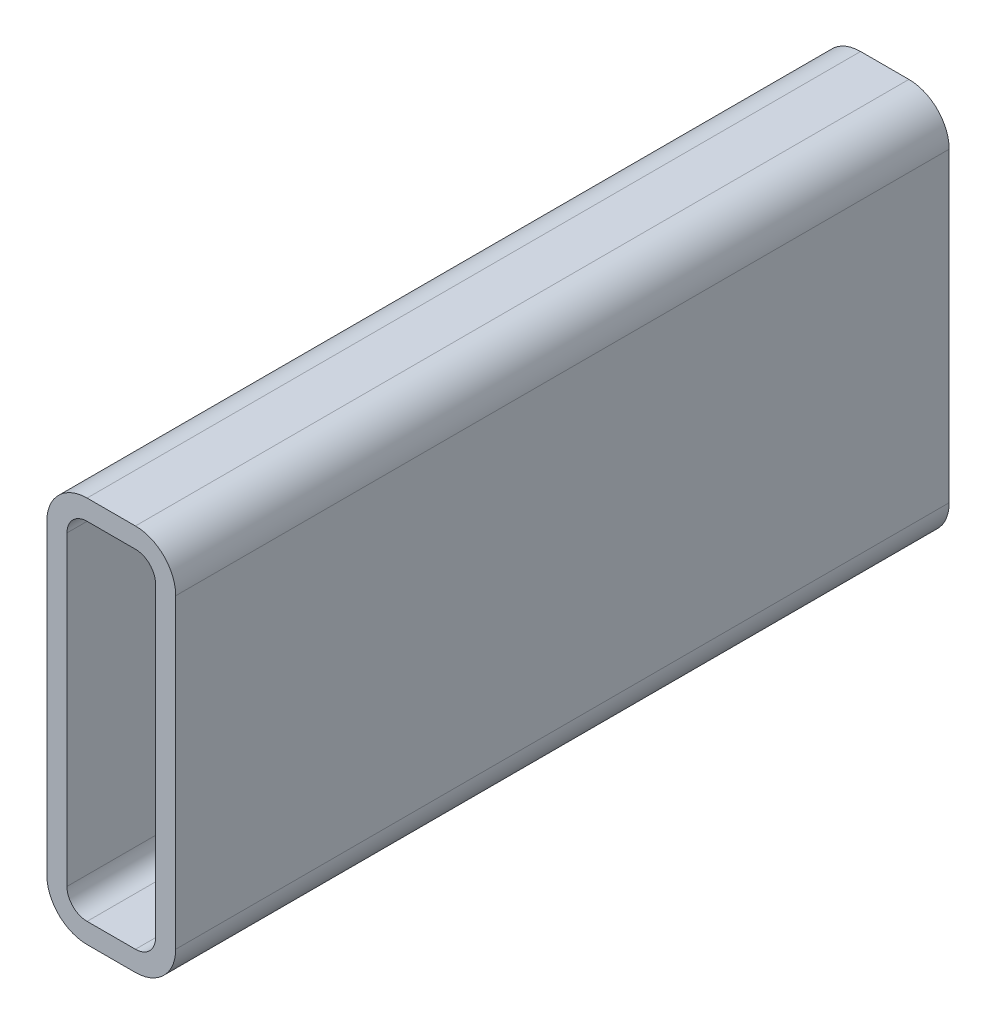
from build123d import *

# Parameters (mm, degrees)
BOSS_EXTRUDE1_DEPTH = 304.8


with BuildPart() as part:
    # Sketch1 → Boss-Extrude1 (new body)
    with BuildSketch(Plane.XY):
        with BuildLine():
            Line((15.875, 152.4), (34.925, 152.4))
            ThreePointArc((34.925, 152.4), (46.150320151, 147.750320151), (50.8, 136.525))
            Line((50.8, 136.525), (50.8, 15.875))
            ThreePointArc((50.8, 15.875), (46.150320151, 4.649679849), (34.925, 0))
            Line((34.925, 0), (15.875, 0))
            ThreePointArc((15.875, 0), (4.649679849, 4.649679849), (0, 15.875))
            Line((0, 15.875), (0, 136.525))
            ThreePointArc((0, 136.525), (4.649679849, 147.750320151), (15.875, 152.4))
        make_face()
        with BuildLine():
            Line((15.875, 144.4625), (34.925, 144.4625))
            ThreePointArc((34.925, 144.4625), (40.537660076, 142.137660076), (42.8625, 136.525))
            Line((42.8625, 136.525), (42.8625, 15.875))
            ThreePointArc((42.8625, 15.875), (40.537660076, 10.262339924), (34.925, 7.9375))
            Line((34.925, 7.9375), (15.875, 7.9375))
            ThreePointArc((15.875, 7.9375), (10.262339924, 10.262339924), (7.9375, 15.875))
            Line((7.9375, 15.875), (7.9375, 136.525))
            ThreePointArc((7.9375, 136.525), (10.262339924, 142.137660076), (15.875, 144.4625))
        make_face(mode=Mode.SUBTRACT)
    extrude(amount=BOSS_EXTRUDE1_DEPTH)


solid = part.part
